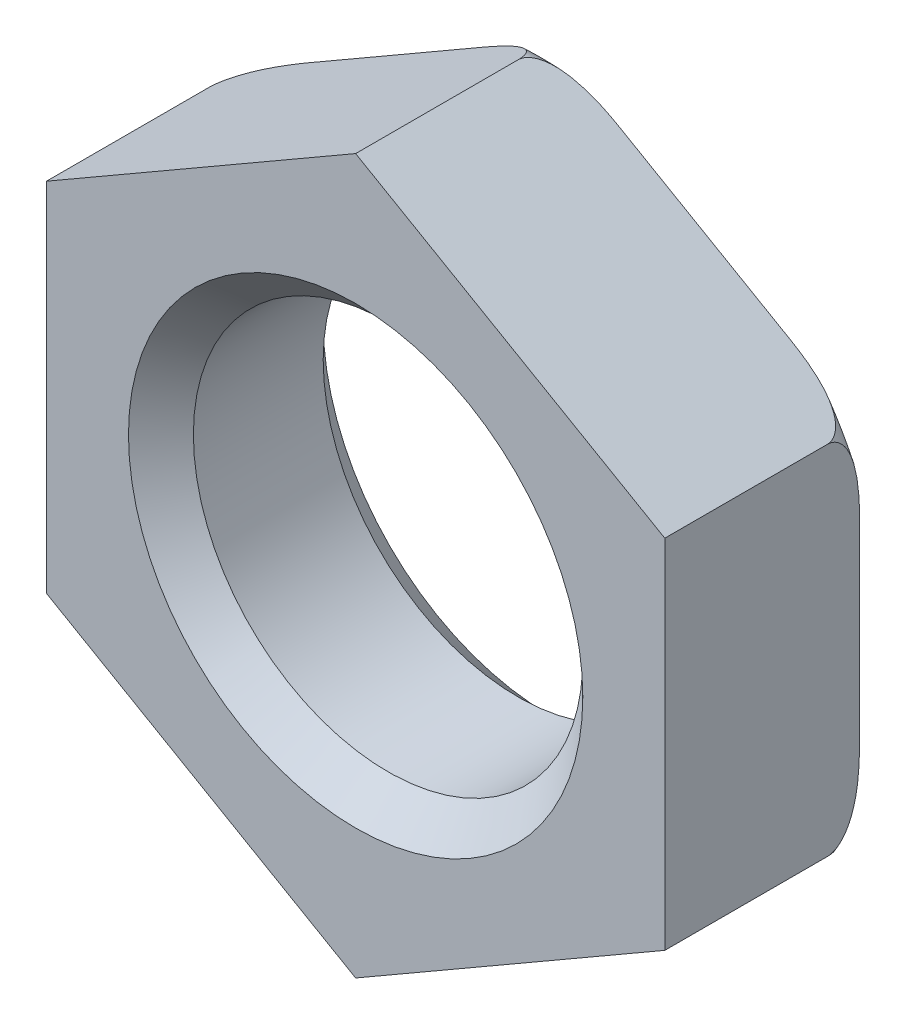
from build123d import *

# Parameters (mm, degrees)
ESQUISSE1_R          = 3
BASE_EXTRUSION_DEPTH = 3
CHANFREIN1_SIZE      = 0.5


with BuildPart() as part:
    # Esquisse1 → Base-Extrusion (new body)
    with BuildSketch(Plane.XY):
        Polygon((0, 5.5), (4.763139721, 2.75), (4.763139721, -2.75), (0, -5.5), (-4.763139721, -2.75), (-4.763139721, 2.75), align=None)
        Circle(ESQUISSE1_R, mode=Mode.SUBTRACT)
    extrude(amount=BASE_EXTRUSION_DEPTH)

    # Chanfrein1
    chanfrein1_edges = [part.edges().sort_by_distance(p)[0] for p in [
        (-3, 0, 0),
        (-3, 0, 3),
    ]]
    chamfer(chanfrein1_edges, length=CHANFREIN1_SIZE)

    # Esquisse2 → Enl_vement de mati_re-R_volution1 (revolve, cut)
    with BuildSketch(Plane(origin=(0, 0, 0), x_dir=(0, 0, -1), z_dir=(1, 0, 0)), mode=Mode.PRIVATE) as enl_vement_de_mati_re_r_volution1_sk:
        with BuildLine():
            Line((0, 5), (0.619609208, 5))
            Line((0.619609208, 5), (0.619609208, 6.000753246))
            Line((0.619609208, 6.000753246), (-0.5, 6.000753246))
            Line((-0.5, 6.000753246), (-0.5, 5.5))
            ThreePointArc((-0.5, 5.5), (-0.146446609, 5.353553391), (0, 5))
        make_face()
    revolve(enl_vement_de_mati_re_r_volution1_sk.sketch.rotate(Axis((0, 0, 0), (0, 0, 1)), 90), axis=Axis((0, 0, 0), (0, 0, 1)), mode=Mode.SUBTRACT)


solid = part.part
